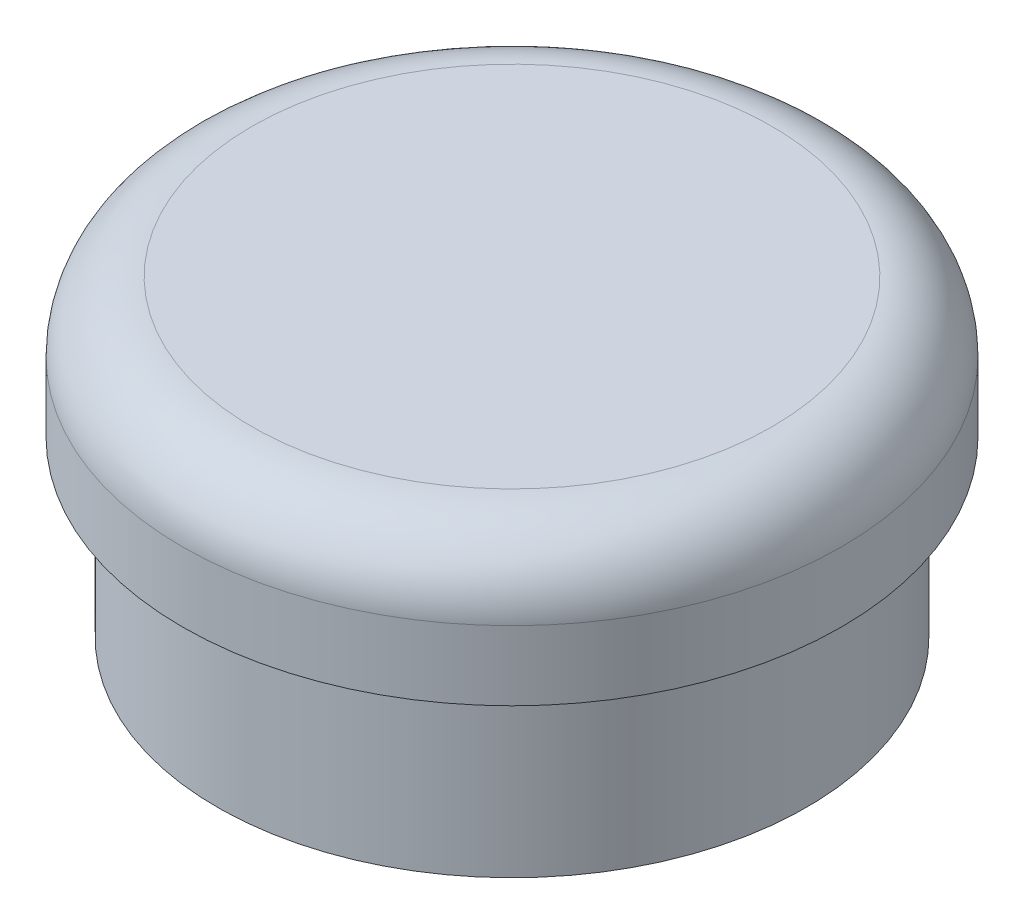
ISO-10303-21;
HEADER;
FILE_DESCRIPTION(('STEP AP214'),'2;1');
FILE_NAME('part.step','',(''),(''),'','','');
FILE_SCHEMA(('AUTOMOTIVE_DESIGN { 1 0 10303 214 1 1 1 1 }'));
ENDSEC;
DATA;
#1=APPLICATION_CONTEXT('core data for automotive mechanical design processes');
#2=APPLICATION_PROTOCOL_DEFINITION('international standard','automotive_design',2000,#1);
#3=PRODUCT_CONTEXT('',#1,'mechanical');
#4=PRODUCT('Part','Part','',(#3));
#5=PRODUCT_RELATED_PRODUCT_CATEGORY('part','',(#4));
#6=PRODUCT_DEFINITION_FORMATION('','',#4);
#7=PRODUCT_DEFINITION_CONTEXT('part definition',#1,'design');
#8=PRODUCT_DEFINITION('design','',#6,#7);
#9=PRODUCT_DEFINITION_SHAPE('','',#8);
#10=(LENGTH_UNIT() NAMED_UNIT(*) SI_UNIT(.MILLI.,.METRE.));
#11=(NAMED_UNIT(*) PLANE_ANGLE_UNIT() SI_UNIT($,.RADIAN.));
#12=(NAMED_UNIT(*) SI_UNIT($,.STERADIAN.) SOLID_ANGLE_UNIT());
#13=UNCERTAINTY_MEASURE_WITH_UNIT(LENGTH_MEASURE(1.E-05),#10,'distance_accuracy_value','');
#14=(GEOMETRIC_REPRESENTATION_CONTEXT(3) GLOBAL_UNCERTAINTY_ASSIGNED_CONTEXT((#13)) GLOBAL_UNIT_ASSIGNED_CONTEXT((#10,
#11,#12)) REPRESENTATION_CONTEXT('',''));
#15=CARTESIAN_POINT('',(0.,0.,0.));
#16=DIRECTION('',(0.,0.,1.));
#17=DIRECTION('',(1.,0.,0.));
#18=AXIS2_PLACEMENT_3D('',#15,#16,#17);
#19=CARTESIAN_POINT('',(-1.10317661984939E-13,0.,0.));
#20=DIRECTION('',(0.,1.,0.));
#21=DIRECTION('',(-1.,0.,0.));
#22=AXIS2_PLACEMENT_3D('',#19,#20,#21);
#23=CYLINDRICAL_SURFACE('',#22,6.5);
#24=CARTESIAN_POINT('',(-1.10430703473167E-13,7.,0.));
#25=DIRECTION('',(0.,1.,0.));
#26=DIRECTION('',(-1.,0.,0.));
#27=AXIS2_PLACEMENT_3D('',#24,#25,#26);
#28=CIRCLE('',#27,6.5);
#29=CARTESIAN_POINT('',(-6.50000000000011,7.,0.));
#30=VERTEX_POINT('',#29);
#31=EDGE_CURVE('E58',#30,#30,#28,.T.);
#32=ORIENTED_EDGE('',*,*,#31,.T.);
#33=EDGE_LOOP('',(#32));
#34=FACE_BOUND('',#33,.T.);
#35=CARTESIAN_POINT('',(-1.10317661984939E-13,0.,0.));
#36=DIRECTION('',(0.,1.,0.));
#37=DIRECTION('',(-1.,0.,0.));
#38=AXIS2_PLACEMENT_3D('',#35,#36,#37);
#39=CIRCLE('',#38,6.5);
#40=CARTESIAN_POINT('',(-6.50000000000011,0.,0.));
#41=VERTEX_POINT('',#40);
#42=EDGE_CURVE('E10',#41,#41,#39,.T.);
#43=ORIENTED_EDGE('',*,*,#42,.F.);
#44=EDGE_LOOP('',(#43));
#45=FACE_BOUND('',#44,.T.);
#46=ADVANCED_FACE('F33',(#34,#45),#23,.F.);
#47=CARTESIAN_POINT('',(8.49999999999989,0.,0.));
#48=DIRECTION('',(0.,-1.,0.));
#49=DIRECTION('',(1.,0.,0.));
#50=AXIS2_PLACEMENT_3D('',#47,#48,#49);
#51=PLANE('',#50);
#52=ORIENTED_EDGE('',*,*,#42,.T.);
#53=EDGE_LOOP('',(#52));
#54=FACE_BOUND('',#53,.T.);
#55=CARTESIAN_POINT('',(-1.10317661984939E-13,0.,0.));
#56=DIRECTION('',(0.,1.,0.));
#57=DIRECTION('',(-1.,0.,0.));
#58=AXIS2_PLACEMENT_3D('',#55,#56,#57);
#59=CIRCLE('',#58,8.5);
#60=CARTESIAN_POINT('',(-8.50000000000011,0.,0.));
#61=VERTEX_POINT('',#60);
#62=EDGE_CURVE('E39',#61,#61,#59,.T.);
#63=ORIENTED_EDGE('',*,*,#62,.F.);
#64=EDGE_LOOP('',(#63));
#65=FACE_BOUND('',#64,.T.);
#66=ADVANCED_FACE('F75',(#54,#65),#51,.T.);
#67=CARTESIAN_POINT('',(-1.10317661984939E-13,0.,0.));
#68=DIRECTION('',(0.,1.,0.));
#69=DIRECTION('',(-1.,0.,0.));
#70=AXIS2_PLACEMENT_3D('',#67,#68,#69);
#71=CYLINDRICAL_SURFACE('',#70,8.5);
#72=ORIENTED_EDGE('',*,*,#62,.T.);
#73=EDGE_LOOP('',(#72));
#74=FACE_BOUND('',#73,.T.);
#75=CARTESIAN_POINT('',(-1.10398405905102E-13,5.,0.));
#76=DIRECTION('',(0.,1.,0.));
#77=DIRECTION('',(-1.,0.,0.));
#78=AXIS2_PLACEMENT_3D('',#75,#76,#77);
#79=CIRCLE('',#78,8.5);
#80=CARTESIAN_POINT('',(-8.50000000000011,5.,0.));
#81=VERTEX_POINT('',#80);
#82=EDGE_CURVE('E43',#81,#81,#79,.T.);
#83=ORIENTED_EDGE('',*,*,#82,.F.);
#84=EDGE_LOOP('',(#83));
#85=FACE_BOUND('',#84,.T.);
#86=ADVANCED_FACE('F79',(#74,#85),#71,.T.);
#87=CARTESIAN_POINT('',(9.49999999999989,5.,0.));
#88=DIRECTION('',(0.,-1.,0.));
#89=DIRECTION('',(1.,0.,0.));
#90=AXIS2_PLACEMENT_3D('',#87,#88,#89);
#91=PLANE('',#90);
#92=ORIENTED_EDGE('',*,*,#82,.T.);
#93=EDGE_LOOP('',(#92));
#94=FACE_BOUND('',#93,.T.);
#95=CARTESIAN_POINT('',(-1.10398405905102E-13,5.,0.));
#96=DIRECTION('',(0.,1.,0.));
#97=DIRECTION('',(-1.,0.,0.));
#98=AXIS2_PLACEMENT_3D('',#95,#96,#97);
#99=CIRCLE('',#98,9.5);
#100=CARTESIAN_POINT('',(-9.50000000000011,5.,0.));
#101=VERTEX_POINT('',#100);
#102=EDGE_CURVE('E47',#101,#101,#99,.T.);
#103=ORIENTED_EDGE('',*,*,#102,.F.);
#104=EDGE_LOOP('',(#103));
#105=FACE_BOUND('',#104,.T.);
#106=ADVANCED_FACE('F83',(#94,#105),#91,.T.);
#107=CARTESIAN_POINT('',(-1.10317661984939E-13,0.,0.));
#108=DIRECTION('',(0.,1.,0.));
#109=DIRECTION('',(-1.,0.,0.));
#110=AXIS2_PLACEMENT_3D('',#107,#108,#109);
#111=CYLINDRICAL_SURFACE('',#110,9.5);
#112=ORIENTED_EDGE('',*,*,#102,.T.);
#113=EDGE_LOOP('',(#112));
#114=FACE_BOUND('',#113,.T.);
#115=CARTESIAN_POINT('',(-1.10430703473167E-13,7.,0.));
#116=DIRECTION('',(0.,1.,0.));
#117=DIRECTION('',(-1.,0.,0.));
#118=AXIS2_PLACEMENT_3D('',#115,#116,#117);
#119=CIRCLE('',#118,9.5);
#120=CARTESIAN_POINT('',(-9.50000000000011,7.,0.));
#121=VERTEX_POINT('',#120);
#122=EDGE_CURVE('E52',#121,#121,#119,.T.);
#123=ORIENTED_EDGE('',*,*,#122,.F.);
#124=EDGE_LOOP('',(#123));
#125=FACE_BOUND('',#124,.T.);
#126=ADVANCED_FACE('F89',(#114,#125),#111,.T.);
#127=CARTESIAN_POINT('',(-1.10154940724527E-13,7.,0.));
#128=DIRECTION('',(0.,1.,0.));
#129=DIRECTION('',(-1.,0.,0.));
#130=AXIS2_PLACEMENT_3D('',#127,#128,#129);
#131=TOROIDAL_SURFACE('',#130,7.5,2.);
#132=ORIENTED_EDGE('',*,*,#122,.T.);
#133=EDGE_LOOP('',(#132));
#134=FACE_BOUND('',#133,.T.);
#135=CARTESIAN_POINT('',(-1.10463001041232E-13,9.,0.));
#136=DIRECTION('',(0.,1.,0.));
#137=DIRECTION('',(-1.,0.,0.));
#138=AXIS2_PLACEMENT_3D('',#135,#136,#137);
#139=CIRCLE('',#138,7.5);
#140=CARTESIAN_POINT('',(-7.50000000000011,9.,0.));
#141=VERTEX_POINT('',#140);
#142=EDGE_CURVE('E55',#141,#141,#139,.T.);
#143=ORIENTED_EDGE('',*,*,#142,.F.);
#144=EDGE_LOOP('',(#143));
#145=FACE_BOUND('',#144,.T.);
#146=ADVANCED_FACE('F71',(#134,#145),#131,.T.);
#147=CARTESIAN_POINT('',(-1.10154940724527E-13,9.00000000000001,0.));
#148=DIRECTION('',(0.,1.,0.));
#149=DIRECTION('',(-1.,0.,0.));
#150=AXIS2_PLACEMENT_3D('',#147,#148,#149);
#151=PLANE('',#150);
#152=ORIENTED_EDGE('',*,*,#142,.T.);
#153=EDGE_LOOP('',(#152));
#154=FACE_BOUND('',#153,.T.);
#155=ADVANCED_FACE('F66',(#154),#151,.T.);
#156=CARTESIAN_POINT('',(6.49999999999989,7.,0.));
#157=DIRECTION('',(0.,-1.,0.));
#158=DIRECTION('',(1.,0.,0.));
#159=AXIS2_PLACEMENT_3D('',#156,#157,#158);
#160=PLANE('',#159);
#161=ORIENTED_EDGE('',*,*,#31,.F.);
#162=EDGE_LOOP('',(#161));
#163=FACE_BOUND('',#162,.T.);
#164=ADVANCED_FACE('F64',(#163),#160,.T.);
#165=CLOSED_SHELL('',(#46,#66,#86,#106,#126,#146,#155,#164));
#166=MANIFOLD_SOLID_BREP('B2',#165);
#167=ADVANCED_BREP_SHAPE_REPRESENTATION('',(#18,#166),#14);
#168=SHAPE_DEFINITION_REPRESENTATION(#9,#167);
ENDSEC;
END-ISO-10303-21;
